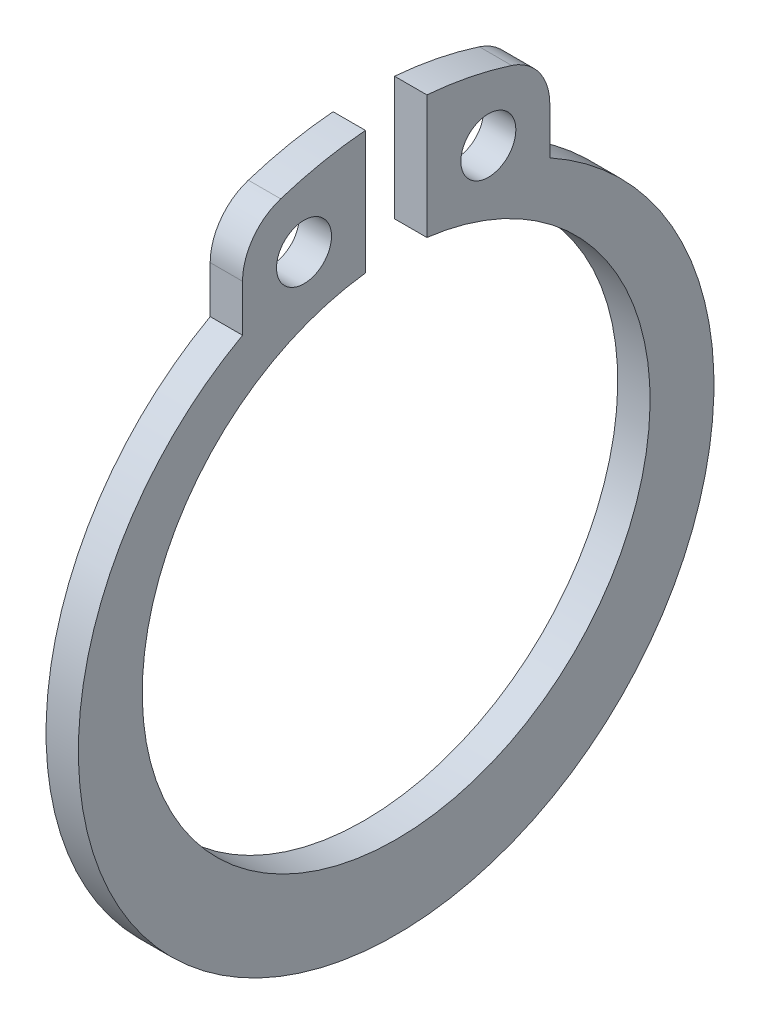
from build123d import *

# Parameters (mm, degrees)
ESQUISSE1_R      = 0.85
EXTRUSION1_DEPTH = 1


with BuildPart() as part:
    # Esquisse1 → Extrusion1 (new body)
    with BuildSketch(Plane(origin=(0, 0, 0), x_dir=(0, 0, -1), z_dir=(1, 0, 0))):
        with BuildLine():
            Line((4.75, 8.025472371), (4.75, 9.471008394))
            ThreePointArc((4.75, 9.471008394), (4.42402321, 10.472037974), (3.571105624, 11.089170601))
            ThreePointArc((3.571105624, 11.089170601), (2.275572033, 11.425597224), (0.95, 11.611201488))
            Line((0.95, 11.611201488), (0.95, 7.792303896))
            ThreePointArc((0.95, 7.792303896), (0, -7.85), (-0.95, 7.792303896))
            Line((-0.95, 7.792303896), (-0.95, 11.611201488))
            ThreePointArc((-0.95, 11.611201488), (-2.275571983, 11.425597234), (-3.571105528, 11.089170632))
            ThreePointArc((-3.571105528, 11.089170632), (-4.42402318, 10.472038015), (-4.75, 9.471008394))
            Line((-4.75, 9.471008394), (-4.75, 8.025472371))
            ThreePointArc((-4.75, 8.025472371), (0, -10.4), (4.75, 8.025472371))
        make_face()
        with Locations((2.85, 9.305193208)):
            Circle(ESQUISSE1_R, mode=Mode.SUBTRACT)
        with Locations((-2.85, 9.305193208)):
            Circle(ESQUISSE1_R, mode=Mode.SUBTRACT)
    extrude(amount=EXTRUSION1_DEPTH)


solid = part.part
